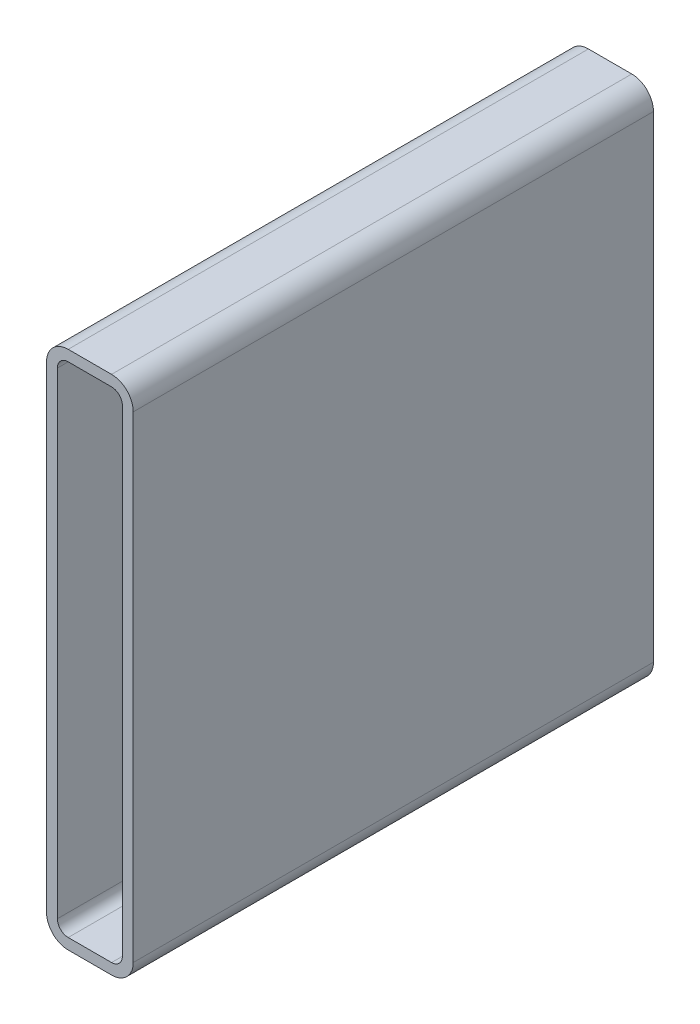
ISO-10303-21;
HEADER;
FILE_DESCRIPTION(('STEP AP214'),'2;1');
FILE_NAME('part.step','',(''),(''),'','','');
FILE_SCHEMA(('AUTOMOTIVE_DESIGN { 1 0 10303 214 1 1 1 1 }'));
ENDSEC;
DATA;
#1=APPLICATION_CONTEXT('core data for automotive mechanical design processes');
#2=APPLICATION_PROTOCOL_DEFINITION('international standard','automotive_design',2000,#1);
#3=PRODUCT_CONTEXT('',#1,'mechanical');
#4=PRODUCT('Part','Part','',(#3));
#5=PRODUCT_RELATED_PRODUCT_CATEGORY('part','',(#4));
#6=PRODUCT_DEFINITION_FORMATION('','',#4);
#7=PRODUCT_DEFINITION_CONTEXT('part definition',#1,'design');
#8=PRODUCT_DEFINITION('design','',#6,#7);
#9=PRODUCT_DEFINITION_SHAPE('','',#8);
#10=(LENGTH_UNIT() NAMED_UNIT(*) SI_UNIT(.MILLI.,.METRE.));
#11=(NAMED_UNIT(*) PLANE_ANGLE_UNIT() SI_UNIT($,.RADIAN.));
#12=(NAMED_UNIT(*) SI_UNIT($,.STERADIAN.) SOLID_ANGLE_UNIT());
#13=UNCERTAINTY_MEASURE_WITH_UNIT(LENGTH_MEASURE(1.E-05),#10,'distance_accuracy_value','');
#14=(GEOMETRIC_REPRESENTATION_CONTEXT(3) GLOBAL_UNCERTAINTY_ASSIGNED_CONTEXT((#13)) GLOBAL_UNIT_ASSIGNED_CONTEXT((#10,
#11,#12)) REPRESENTATION_CONTEXT('',''));
#15=CARTESIAN_POINT('',(0.,0.,0.));
#16=DIRECTION('',(0.,0.,1.));
#17=DIRECTION('',(1.,0.,0.));
#18=AXIS2_PLACEMENT_3D('',#15,#16,#17);
#19=CARTESIAN_POINT('',(12.7,292.1,304.8));
#20=DIRECTION('',(0.,0.,1.));
#21=DIRECTION('',(1.,0.,0.));
#22=AXIS2_PLACEMENT_3D('',#19,#20,#21);
#23=PLANE('',#22);
#24=CARTESIAN_POINT('',(12.7,292.1,304.8));
#25=DIRECTION('',(0.,0.,1.));
#26=DIRECTION('',(1.,0.,0.));
#27=AXIS2_PLACEMENT_3D('',#24,#25,#26);
#28=CIRCLE('',#27,12.7);
#29=CARTESIAN_POINT('',(12.7,304.8,304.8));
#30=VERTEX_POINT('',#29);
#31=CARTESIAN_POINT('',(0.,292.1,304.8));
#32=VERTEX_POINT('',#31);
#33=EDGE_CURVE('E211',#30,#32,#28,.T.);
#34=ORIENTED_EDGE('',*,*,#33,.T.);
#35=DIRECTION('',(0.,-1.,0.));
#36=VECTOR('',#35,1.);
#37=CARTESIAN_POINT('',(0.,12.7,304.8));
#38=LINE('',#37,#36);
#39=CARTESIAN_POINT('',(0.,12.7,304.8));
#40=VERTEX_POINT('',#39);
#41=EDGE_CURVE('E214',#32,#40,#38,.T.);
#42=ORIENTED_EDGE('',*,*,#41,.T.);
#43=CARTESIAN_POINT('',(12.7,12.7,304.8));
#44=DIRECTION('',(0.,0.,1.));
#45=DIRECTION('',(1.,0.,0.));
#46=AXIS2_PLACEMENT_3D('',#43,#44,#45);
#47=CIRCLE('',#46,12.7);
#48=CARTESIAN_POINT('',(12.7,0.,304.8));
#49=VERTEX_POINT('',#48);
#50=EDGE_CURVE('E217',#40,#49,#47,.T.);
#51=ORIENTED_EDGE('',*,*,#50,.T.);
#52=DIRECTION('',(1.,0.,0.));
#53=VECTOR('',#52,1.);
#54=CARTESIAN_POINT('',(38.1,0.,304.8));
#55=LINE('',#54,#53);
#56=CARTESIAN_POINT('',(38.1,0.,304.8));
#57=VERTEX_POINT('',#56);
#58=EDGE_CURVE('E219',#49,#57,#55,.T.);
#59=ORIENTED_EDGE('',*,*,#58,.T.);
#60=CARTESIAN_POINT('',(38.1,12.7,304.8));
#61=DIRECTION('',(0.,0.,1.));
#62=DIRECTION('',(1.,0.,0.));
#63=AXIS2_PLACEMENT_3D('',#60,#61,#62);
#64=CIRCLE('',#63,12.7);
#65=CARTESIAN_POINT('',(50.8,12.7,304.8));
#66=VERTEX_POINT('',#65);
#67=EDGE_CURVE('E221',#57,#66,#64,.T.);
#68=ORIENTED_EDGE('',*,*,#67,.T.);
#69=DIRECTION('',(0.,1.,0.));
#70=VECTOR('',#69,1.);
#71=CARTESIAN_POINT('',(50.8,292.1,304.8));
#72=LINE('',#71,#70);
#73=CARTESIAN_POINT('',(50.8,292.1,304.8));
#74=VERTEX_POINT('',#73);
#75=EDGE_CURVE('E223',#66,#74,#72,.T.);
#76=ORIENTED_EDGE('',*,*,#75,.T.);
#77=CARTESIAN_POINT('',(38.1,292.1,304.8));
#78=DIRECTION('',(0.,0.,1.));
#79=DIRECTION('',(1.,0.,0.));
#80=AXIS2_PLACEMENT_3D('',#77,#78,#79);
#81=CIRCLE('',#80,12.7);
#82=CARTESIAN_POINT('',(38.1,304.8,304.8));
#83=VERTEX_POINT('',#82);
#84=EDGE_CURVE('E225',#74,#83,#81,.T.);
#85=ORIENTED_EDGE('',*,*,#84,.T.);
#86=DIRECTION('',(-1.,0.,0.));
#87=VECTOR('',#86,1.);
#88=CARTESIAN_POINT('',(12.7,304.8,304.8));
#89=LINE('',#88,#87);
#90=EDGE_CURVE('E227',#83,#30,#89,.T.);
#91=ORIENTED_EDGE('',*,*,#90,.T.);
#92=EDGE_LOOP('',(#34,#42,#51,#59,#68,#76,#85,#91));
#93=FACE_BOUND('',#92,.T.);
#94=DIRECTION('',(0.,-1.,0.));
#95=VECTOR('',#94,1.);
#96=CARTESIAN_POINT('',(6.35,12.7,304.8));
#97=LINE('',#96,#95);
#98=CARTESIAN_POINT('',(6.35,292.1,304.8));
#99=VERTEX_POINT('',#98);
#100=CARTESIAN_POINT('',(6.35,12.7,304.8));
#101=VERTEX_POINT('',#100);
#102=EDGE_CURVE('E154',#99,#101,#97,.T.);
#103=ORIENTED_EDGE('',*,*,#102,.F.);
#104=CARTESIAN_POINT('',(12.7,292.1,304.8));
#105=DIRECTION('',(0.,0.,1.));
#106=DIRECTION('',(1.,0.,0.));
#107=AXIS2_PLACEMENT_3D('',#104,#105,#106);
#108=CIRCLE('',#107,6.35000000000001);
#109=CARTESIAN_POINT('',(12.7,298.45,304.8));
#110=VERTEX_POINT('',#109);
#111=EDGE_CURVE('E146',#110,#99,#108,.T.);
#112=ORIENTED_EDGE('',*,*,#111,.F.);
#113=DIRECTION('',(-1.,0.,0.));
#114=VECTOR('',#113,1.);
#115=CARTESIAN_POINT('',(12.7,298.45,304.8));
#116=LINE('',#115,#114);
#117=CARTESIAN_POINT('',(38.1,298.45,304.8));
#118=VERTEX_POINT('',#117);
#119=EDGE_CURVE('E179',#118,#110,#116,.T.);
#120=ORIENTED_EDGE('',*,*,#119,.F.);
#121=CARTESIAN_POINT('',(38.1,292.1,304.8));
#122=DIRECTION('',(0.,0.,1.));
#123=DIRECTION('',(1.,0.,0.));
#124=AXIS2_PLACEMENT_3D('',#121,#122,#123);
#125=CIRCLE('',#124,6.35000000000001);
#126=CARTESIAN_POINT('',(44.45,292.1,304.8));
#127=VERTEX_POINT('',#126);
#128=EDGE_CURVE('E177',#127,#118,#125,.T.);
#129=ORIENTED_EDGE('',*,*,#128,.F.);
#130=DIRECTION('',(0.,1.,0.));
#131=VECTOR('',#130,1.);
#132=CARTESIAN_POINT('',(44.45,292.1,304.8));
#133=LINE('',#132,#131);
#134=CARTESIAN_POINT('',(44.45,12.7,304.8));
#135=VERTEX_POINT('',#134);
#136=EDGE_CURVE('E175',#135,#127,#133,.T.);
#137=ORIENTED_EDGE('',*,*,#136,.F.);
#138=CARTESIAN_POINT('',(38.1,12.7,304.8));
#139=DIRECTION('',(0.,0.,1.));
#140=DIRECTION('',(1.,0.,0.));
#141=AXIS2_PLACEMENT_3D('',#138,#139,#140);
#142=CIRCLE('',#141,6.35);
#143=CARTESIAN_POINT('',(38.1,6.35,304.8));
#144=VERTEX_POINT('',#143);
#145=EDGE_CURVE('E173',#144,#135,#142,.T.);
#146=ORIENTED_EDGE('',*,*,#145,.F.);
#147=DIRECTION('',(1.,0.,0.));
#148=VECTOR('',#147,1.);
#149=CARTESIAN_POINT('',(38.1,6.35,304.8));
#150=LINE('',#149,#148);
#151=CARTESIAN_POINT('',(12.7,6.35,304.8));
#152=VERTEX_POINT('',#151);
#153=EDGE_CURVE('E169',#152,#144,#150,.T.);
#154=ORIENTED_EDGE('',*,*,#153,.F.);
#155=CARTESIAN_POINT('',(12.7,12.7,304.8));
#156=DIRECTION('',(0.,0.,1.));
#157=DIRECTION('',(1.,0.,0.));
#158=AXIS2_PLACEMENT_3D('',#155,#156,#157);
#159=CIRCLE('',#158,6.35);
#160=EDGE_CURVE('E167',#101,#152,#159,.T.);
#161=ORIENTED_EDGE('',*,*,#160,.F.);
#162=EDGE_LOOP('',(#103,#112,#120,#129,#137,#146,#154,#161));
#163=FACE_BOUND('',#162,.T.);
#164=ADVANCED_FACE('F33',(#93,#163),#23,.T.);
#165=CARTESIAN_POINT('',(12.7,292.1,0.));
#166=DIRECTION('',(0.,0.,1.));
#167=DIRECTION('',(1.,0.,0.));
#168=AXIS2_PLACEMENT_3D('',#165,#166,#167);
#169=PLANE('',#168);
#170=CARTESIAN_POINT('',(12.7,292.1,0.));
#171=DIRECTION('',(0.,0.,1.));
#172=DIRECTION('',(1.,0.,0.));
#173=AXIS2_PLACEMENT_3D('',#170,#171,#172);
#174=CIRCLE('',#173,12.7);
#175=CARTESIAN_POINT('',(12.7,304.8,0.));
#176=VERTEX_POINT('',#175);
#177=CARTESIAN_POINT('',(0.,292.1,0.));
#178=VERTEX_POINT('',#177);
#179=EDGE_CURVE('E162',#176,#178,#174,.T.);
#180=ORIENTED_EDGE('',*,*,#179,.F.);
#181=DIRECTION('',(-1.,0.,0.));
#182=VECTOR('',#181,1.);
#183=CARTESIAN_POINT('',(12.7,304.8,0.));
#184=LINE('',#183,#182);
#185=CARTESIAN_POINT('',(38.1,304.8,0.));
#186=VERTEX_POINT('',#185);
#187=EDGE_CURVE('E215',#186,#176,#184,.T.);
#188=ORIENTED_EDGE('',*,*,#187,.F.);
#189=CARTESIAN_POINT('',(38.1,292.1,0.));
#190=DIRECTION('',(0.,0.,1.));
#191=DIRECTION('',(1.,0.,0.));
#192=AXIS2_PLACEMENT_3D('',#189,#190,#191);
#193=CIRCLE('',#192,12.7);
#194=CARTESIAN_POINT('',(50.8,292.1,0.));
#195=VERTEX_POINT('',#194);
#196=EDGE_CURVE('E242',#195,#186,#193,.T.);
#197=ORIENTED_EDGE('',*,*,#196,.F.);
#198=DIRECTION('',(0.,1.,0.));
#199=VECTOR('',#198,1.);
#200=CARTESIAN_POINT('',(50.8,292.1,0.));
#201=LINE('',#200,#199);
#202=CARTESIAN_POINT('',(50.8,12.7,0.));
#203=VERTEX_POINT('',#202);
#204=EDGE_CURVE('E240',#203,#195,#201,.T.);
#205=ORIENTED_EDGE('',*,*,#204,.F.);
#206=CARTESIAN_POINT('',(38.1,12.7,0.));
#207=DIRECTION('',(0.,0.,1.));
#208=DIRECTION('',(1.,0.,0.));
#209=AXIS2_PLACEMENT_3D('',#206,#207,#208);
#210=CIRCLE('',#209,12.7);
#211=CARTESIAN_POINT('',(38.1,0.,0.));
#212=VERTEX_POINT('',#211);
#213=EDGE_CURVE('E238',#212,#203,#210,.T.);
#214=ORIENTED_EDGE('',*,*,#213,.F.);
#215=DIRECTION('',(1.,0.,0.));
#216=VECTOR('',#215,1.);
#217=CARTESIAN_POINT('',(38.1,0.,0.));
#218=LINE('',#217,#216);
#219=CARTESIAN_POINT('',(12.7,0.,0.));
#220=VERTEX_POINT('',#219);
#221=EDGE_CURVE('E236',#220,#212,#218,.T.);
#222=ORIENTED_EDGE('',*,*,#221,.F.);
#223=CARTESIAN_POINT('',(12.7,12.7,0.));
#224=DIRECTION('',(0.,0.,1.));
#225=DIRECTION('',(1.,0.,0.));
#226=AXIS2_PLACEMENT_3D('',#223,#224,#225);
#227=CIRCLE('',#226,12.7);
#228=CARTESIAN_POINT('',(0.,12.7,0.));
#229=VERTEX_POINT('',#228);
#230=EDGE_CURVE('E234',#229,#220,#227,.T.);
#231=ORIENTED_EDGE('',*,*,#230,.F.);
#232=DIRECTION('',(0.,-1.,0.));
#233=VECTOR('',#232,1.);
#234=CARTESIAN_POINT('',(0.,12.7,0.));
#235=LINE('',#234,#233);
#236=EDGE_CURVE('E232',#178,#229,#235,.T.);
#237=ORIENTED_EDGE('',*,*,#236,.F.);
#238=EDGE_LOOP('',(#180,#188,#197,#205,#214,#222,#231,#237));
#239=FACE_BOUND('',#238,.T.);
#240=CARTESIAN_POINT('',(12.7,292.1,0.));
#241=DIRECTION('',(0.,0.,1.));
#242=DIRECTION('',(1.,0.,0.));
#243=AXIS2_PLACEMENT_3D('',#240,#241,#242);
#244=CIRCLE('',#243,6.35000000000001);
#245=CARTESIAN_POINT('',(12.7,298.45,0.));
#246=VERTEX_POINT('',#245);
#247=CARTESIAN_POINT('',(6.35,292.1,0.));
#248=VERTEX_POINT('',#247);
#249=EDGE_CURVE('E56',#246,#248,#244,.T.);
#250=ORIENTED_EDGE('',*,*,#249,.T.);
#251=DIRECTION('',(0.,-1.,0.));
#252=VECTOR('',#251,1.);
#253=CARTESIAN_POINT('',(6.35,12.7,0.));
#254=LINE('',#253,#252);
#255=CARTESIAN_POINT('',(6.35,12.7,0.));
#256=VERTEX_POINT('',#255);
#257=EDGE_CURVE('E161',#248,#256,#254,.T.);
#258=ORIENTED_EDGE('',*,*,#257,.T.);
#259=CARTESIAN_POINT('',(12.7,12.7,0.));
#260=DIRECTION('',(0.,0.,1.));
#261=DIRECTION('',(1.,0.,0.));
#262=AXIS2_PLACEMENT_3D('',#259,#260,#261);
#263=CIRCLE('',#262,6.35);
#264=CARTESIAN_POINT('',(12.7,6.35,0.));
#265=VERTEX_POINT('',#264);
#266=EDGE_CURVE('E183',#256,#265,#263,.T.);
#267=ORIENTED_EDGE('',*,*,#266,.T.);
#268=DIRECTION('',(1.,0.,0.));
#269=VECTOR('',#268,1.);
#270=CARTESIAN_POINT('',(38.1,6.35,0.));
#271=LINE('',#270,#269);
#272=CARTESIAN_POINT('',(38.1,6.35,0.));
#273=VERTEX_POINT('',#272);
#274=EDGE_CURVE('E186',#265,#273,#271,.T.);
#275=ORIENTED_EDGE('',*,*,#274,.T.);
#276=CARTESIAN_POINT('',(38.1,12.7,0.));
#277=DIRECTION('',(0.,0.,1.));
#278=DIRECTION('',(1.,0.,0.));
#279=AXIS2_PLACEMENT_3D('',#276,#277,#278);
#280=CIRCLE('',#279,6.35);
#281=CARTESIAN_POINT('',(44.45,12.7,0.));
#282=VERTEX_POINT('',#281);
#283=EDGE_CURVE('E189',#273,#282,#280,.T.);
#284=ORIENTED_EDGE('',*,*,#283,.T.);
#285=DIRECTION('',(0.,1.,0.));
#286=VECTOR('',#285,1.);
#287=CARTESIAN_POINT('',(44.45,292.1,0.));
#288=LINE('',#287,#286);
#289=CARTESIAN_POINT('',(44.45,292.1,0.));
#290=VERTEX_POINT('',#289);
#291=EDGE_CURVE('E192',#282,#290,#288,.T.);
#292=ORIENTED_EDGE('',*,*,#291,.T.);
#293=CARTESIAN_POINT('',(38.1,292.1,0.));
#294=DIRECTION('',(0.,0.,1.));
#295=DIRECTION('',(1.,0.,0.));
#296=AXIS2_PLACEMENT_3D('',#293,#294,#295);
#297=CIRCLE('',#296,6.35000000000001);
#298=CARTESIAN_POINT('',(38.1,298.45,0.));
#299=VERTEX_POINT('',#298);
#300=EDGE_CURVE('E195',#290,#299,#297,.T.);
#301=ORIENTED_EDGE('',*,*,#300,.T.);
#302=DIRECTION('',(-1.,0.,0.));
#303=VECTOR('',#302,1.);
#304=CARTESIAN_POINT('',(12.7,298.45,0.));
#305=LINE('',#304,#303);
#306=EDGE_CURVE('E155',#299,#246,#305,.T.);
#307=ORIENTED_EDGE('',*,*,#306,.T.);
#308=EDGE_LOOP('',(#250,#258,#267,#275,#284,#292,#301,#307));
#309=FACE_BOUND('',#308,.T.);
#310=ADVANCED_FACE('F272',(#239,#309),#169,.F.);
#311=CARTESIAN_POINT('',(12.7,292.1,304.8));
#312=DIRECTION('',(0.,0.,-1.));
#313=DIRECTION('',(-1.,0.,0.));
#314=AXIS2_PLACEMENT_3D('',#311,#312,#313);
#315=CYLINDRICAL_SURFACE('',#314,12.7);
#316=ORIENTED_EDGE('',*,*,#179,.T.);
#317=DIRECTION('',(0.,0.,-1.));
#318=VECTOR('',#317,1.);
#319=CARTESIAN_POINT('',(0.,292.1,304.8));
#320=LINE('',#319,#318);
#321=EDGE_CURVE('E11',#32,#178,#320,.T.);
#322=ORIENTED_EDGE('',*,*,#321,.F.);
#323=ORIENTED_EDGE('',*,*,#33,.F.);
#324=DIRECTION('',(0.,0.,-1.));
#325=VECTOR('',#324,1.);
#326=CARTESIAN_POINT('',(12.7,304.8,304.8));
#327=LINE('',#326,#325);
#328=EDGE_CURVE('E229',#30,#176,#327,.T.);
#329=ORIENTED_EDGE('',*,*,#328,.T.);
#330=EDGE_LOOP('',(#316,#322,#323,#329));
#331=FACE_BOUND('',#330,.T.);
#332=ADVANCED_FACE('F35',(#331),#315,.T.);
#333=CARTESIAN_POINT('',(0.,12.7,304.8));
#334=DIRECTION('',(1.,0.,0.));
#335=DIRECTION('',(0.,0.,-1.));
#336=AXIS2_PLACEMENT_3D('',#333,#334,#335);
#337=PLANE('',#336);
#338=ORIENTED_EDGE('',*,*,#236,.T.);
#339=DIRECTION('',(0.,0.,-1.));
#340=VECTOR('',#339,1.);
#341=CARTESIAN_POINT('',(0.,12.7,304.8));
#342=LINE('',#341,#340);
#343=EDGE_CURVE('E41',#40,#229,#342,.T.);
#344=ORIENTED_EDGE('',*,*,#343,.F.);
#345=ORIENTED_EDGE('',*,*,#41,.F.);
#346=ORIENTED_EDGE('',*,*,#321,.T.);
#347=EDGE_LOOP('',(#338,#344,#345,#346));
#348=FACE_BOUND('',#347,.T.);
#349=ADVANCED_FACE('F289',(#348),#337,.F.);
#350=CARTESIAN_POINT('',(12.7,12.7,304.8));
#351=DIRECTION('',(0.,0.,-1.));
#352=DIRECTION('',(-1.,0.,0.));
#353=AXIS2_PLACEMENT_3D('',#350,#351,#352);
#354=CYLINDRICAL_SURFACE('',#353,12.7);
#355=ORIENTED_EDGE('',*,*,#230,.T.);
#356=DIRECTION('',(0.,0.,-1.));
#357=VECTOR('',#356,1.);
#358=CARTESIAN_POINT('',(12.7,0.,304.8));
#359=LINE('',#358,#357);
#360=EDGE_CURVE('E259',#49,#220,#359,.T.);
#361=ORIENTED_EDGE('',*,*,#360,.F.);
#362=ORIENTED_EDGE('',*,*,#50,.F.);
#363=ORIENTED_EDGE('',*,*,#343,.T.);
#364=EDGE_LOOP('',(#355,#361,#362,#363));
#365=FACE_BOUND('',#364,.T.);
#366=ADVANCED_FACE('F266',(#365),#354,.T.);
#367=CARTESIAN_POINT('',(38.1,0.,304.8));
#368=DIRECTION('',(0.,1.,0.));
#369=DIRECTION('',(0.,0.,1.));
#370=AXIS2_PLACEMENT_3D('',#367,#368,#369);
#371=PLANE('',#370);
#372=ORIENTED_EDGE('',*,*,#221,.T.);
#373=DIRECTION('',(0.,0.,-1.));
#374=VECTOR('',#373,1.);
#375=CARTESIAN_POINT('',(38.1,0.,304.8));
#376=LINE('',#375,#374);
#377=EDGE_CURVE('E256',#57,#212,#376,.T.);
#378=ORIENTED_EDGE('',*,*,#377,.F.);
#379=ORIENTED_EDGE('',*,*,#58,.F.);
#380=ORIENTED_EDGE('',*,*,#360,.T.);
#381=EDGE_LOOP('',(#372,#378,#379,#380));
#382=FACE_BOUND('',#381,.T.);
#383=ADVANCED_FACE('F278',(#382),#371,.F.);
#384=CARTESIAN_POINT('',(38.1,12.7,304.8));
#385=DIRECTION('',(0.,0.,-1.));
#386=DIRECTION('',(-1.,0.,0.));
#387=AXIS2_PLACEMENT_3D('',#384,#385,#386);
#388=CYLINDRICAL_SURFACE('',#387,12.7);
#389=ORIENTED_EDGE('',*,*,#213,.T.);
#390=DIRECTION('',(0.,0.,-1.));
#391=VECTOR('',#390,1.);
#392=CARTESIAN_POINT('',(50.8,12.7,304.8));
#393=LINE('',#392,#391);
#394=EDGE_CURVE('E253',#66,#203,#393,.T.);
#395=ORIENTED_EDGE('',*,*,#394,.F.);
#396=ORIENTED_EDGE('',*,*,#67,.F.);
#397=ORIENTED_EDGE('',*,*,#377,.T.);
#398=EDGE_LOOP('',(#389,#395,#396,#397));
#399=FACE_BOUND('',#398,.T.);
#400=ADVANCED_FACE('F282',(#399),#388,.T.);
#401=CARTESIAN_POINT('',(50.8,292.1,304.8));
#402=DIRECTION('',(-1.,0.,0.));
#403=DIRECTION('',(0.,0.,1.));
#404=AXIS2_PLACEMENT_3D('',#401,#402,#403);
#405=PLANE('',#404);
#406=ORIENTED_EDGE('',*,*,#204,.T.);
#407=DIRECTION('',(0.,0.,-1.));
#408=VECTOR('',#407,1.);
#409=CARTESIAN_POINT('',(50.8,292.1,304.8));
#410=LINE('',#409,#408);
#411=EDGE_CURVE('E250',#74,#195,#410,.T.);
#412=ORIENTED_EDGE('',*,*,#411,.F.);
#413=ORIENTED_EDGE('',*,*,#75,.F.);
#414=ORIENTED_EDGE('',*,*,#394,.T.);
#415=EDGE_LOOP('',(#406,#412,#413,#414));
#416=FACE_BOUND('',#415,.T.);
#417=ADVANCED_FACE('F302',(#416),#405,.F.);
#418=CARTESIAN_POINT('',(38.1,292.1,304.8));
#419=DIRECTION('',(0.,0.,-1.));
#420=DIRECTION('',(-1.,0.,0.));
#421=AXIS2_PLACEMENT_3D('',#418,#419,#420);
#422=CYLINDRICAL_SURFACE('',#421,12.7);
#423=ORIENTED_EDGE('',*,*,#196,.T.);
#424=DIRECTION('',(0.,0.,-1.));
#425=VECTOR('',#424,1.);
#426=CARTESIAN_POINT('',(38.1,304.8,304.8));
#427=LINE('',#426,#425);
#428=EDGE_CURVE('E247',#83,#186,#427,.T.);
#429=ORIENTED_EDGE('',*,*,#428,.F.);
#430=ORIENTED_EDGE('',*,*,#84,.F.);
#431=ORIENTED_EDGE('',*,*,#411,.T.);
#432=EDGE_LOOP('',(#423,#429,#430,#431));
#433=FACE_BOUND('',#432,.T.);
#434=ADVANCED_FACE('F300',(#433),#422,.T.);
#435=CARTESIAN_POINT('',(12.7,304.8,304.8));
#436=DIRECTION('',(0.,-1.,0.));
#437=DIRECTION('',(0.,0.,-1.));
#438=AXIS2_PLACEMENT_3D('',#435,#436,#437);
#439=PLANE('',#438);
#440=ORIENTED_EDGE('',*,*,#187,.T.);
#441=ORIENTED_EDGE('',*,*,#328,.F.);
#442=ORIENTED_EDGE('',*,*,#90,.F.);
#443=ORIENTED_EDGE('',*,*,#428,.T.);
#444=EDGE_LOOP('',(#440,#441,#442,#443));
#445=FACE_BOUND('',#444,.T.);
#446=ADVANCED_FACE('F295',(#445),#439,.F.);
#447=CARTESIAN_POINT('',(12.7,292.1,304.8));
#448=DIRECTION('',(0.,0.,-1.));
#449=DIRECTION('',(-1.,0.,0.));
#450=AXIS2_PLACEMENT_3D('',#447,#448,#449);
#451=CYLINDRICAL_SURFACE('',#450,6.35000000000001);
#452=ORIENTED_EDGE('',*,*,#249,.F.);
#453=DIRECTION('',(0.,0.,-1.));
#454=VECTOR('',#453,1.);
#455=CARTESIAN_POINT('',(12.7,298.45,304.8));
#456=LINE('',#455,#454);
#457=EDGE_CURVE('E150',#110,#246,#456,.T.);
#458=ORIENTED_EDGE('',*,*,#457,.F.);
#459=ORIENTED_EDGE('',*,*,#111,.T.);
#460=DIRECTION('',(0.,0.,-1.));
#461=VECTOR('',#460,1.);
#462=CARTESIAN_POINT('',(6.35,292.1,304.8));
#463=LINE('',#462,#461);
#464=EDGE_CURVE('E149',#99,#248,#463,.T.);
#465=ORIENTED_EDGE('',*,*,#464,.T.);
#466=EDGE_LOOP('',(#452,#458,#459,#465));
#467=FACE_BOUND('',#466,.T.);
#468=ADVANCED_FACE('F148',(#467),#451,.F.);
#469=CARTESIAN_POINT('',(6.35,12.7,304.8));
#470=DIRECTION('',(1.,0.,0.));
#471=DIRECTION('',(0.,0.,-1.));
#472=AXIS2_PLACEMENT_3D('',#469,#470,#471);
#473=PLANE('',#472);
#474=ORIENTED_EDGE('',*,*,#257,.F.);
#475=ORIENTED_EDGE('',*,*,#464,.F.);
#476=ORIENTED_EDGE('',*,*,#102,.T.);
#477=DIRECTION('',(0.,0.,-1.));
#478=VECTOR('',#477,1.);
#479=CARTESIAN_POINT('',(6.35,12.7,304.8));
#480=LINE('',#479,#478);
#481=EDGE_CURVE('E163',#101,#256,#480,.T.);
#482=ORIENTED_EDGE('',*,*,#481,.T.);
#483=EDGE_LOOP('',(#474,#475,#476,#482));
#484=FACE_BOUND('',#483,.T.);
#485=ADVANCED_FACE('F158',(#484),#473,.T.);
#486=CARTESIAN_POINT('',(12.7,12.7,304.8));
#487=DIRECTION('',(0.,0.,-1.));
#488=DIRECTION('',(-1.,0.,0.));
#489=AXIS2_PLACEMENT_3D('',#486,#487,#488);
#490=CYLINDRICAL_SURFACE('',#489,6.35);
#491=ORIENTED_EDGE('',*,*,#266,.F.);
#492=ORIENTED_EDGE('',*,*,#481,.F.);
#493=ORIENTED_EDGE('',*,*,#160,.T.);
#494=DIRECTION('',(0.,0.,-1.));
#495=VECTOR('',#494,1.);
#496=CARTESIAN_POINT('',(12.7,6.35,304.8));
#497=LINE('',#496,#495);
#498=EDGE_CURVE('E208',#152,#265,#497,.T.);
#499=ORIENTED_EDGE('',*,*,#498,.T.);
#500=EDGE_LOOP('',(#491,#492,#493,#499));
#501=FACE_BOUND('',#500,.T.);
#502=ADVANCED_FACE('F327',(#501),#490,.F.);
#503=CARTESIAN_POINT('',(38.1,6.35,304.8));
#504=DIRECTION('',(0.,1.,0.));
#505=DIRECTION('',(0.,0.,1.));
#506=AXIS2_PLACEMENT_3D('',#503,#504,#505);
#507=PLANE('',#506);
#508=ORIENTED_EDGE('',*,*,#274,.F.);
#509=ORIENTED_EDGE('',*,*,#498,.F.);
#510=ORIENTED_EDGE('',*,*,#153,.T.);
#511=DIRECTION('',(0.,0.,-1.));
#512=VECTOR('',#511,1.);
#513=CARTESIAN_POINT('',(38.1,6.35,304.8));
#514=LINE('',#513,#512);
#515=EDGE_CURVE('E206',#144,#273,#514,.T.);
#516=ORIENTED_EDGE('',*,*,#515,.T.);
#517=EDGE_LOOP('',(#508,#509,#510,#516));
#518=FACE_BOUND('',#517,.T.);
#519=ADVANCED_FACE('F331',(#518),#507,.T.);
#520=CARTESIAN_POINT('',(38.1,12.7,304.8));
#521=DIRECTION('',(0.,0.,-1.));
#522=DIRECTION('',(-1.,0.,0.));
#523=AXIS2_PLACEMENT_3D('',#520,#521,#522);
#524=CYLINDRICAL_SURFACE('',#523,6.35);
#525=ORIENTED_EDGE('',*,*,#283,.F.);
#526=ORIENTED_EDGE('',*,*,#515,.F.);
#527=ORIENTED_EDGE('',*,*,#145,.T.);
#528=DIRECTION('',(0.,0.,-1.));
#529=VECTOR('',#528,1.);
#530=CARTESIAN_POINT('',(44.45,12.7,304.8));
#531=LINE('',#530,#529);
#532=EDGE_CURVE('E204',#135,#282,#531,.T.);
#533=ORIENTED_EDGE('',*,*,#532,.T.);
#534=EDGE_LOOP('',(#525,#526,#527,#533));
#535=FACE_BOUND('',#534,.T.);
#536=ADVANCED_FACE('F337',(#535),#524,.F.);
#537=CARTESIAN_POINT('',(44.45,292.1,304.8));
#538=DIRECTION('',(-1.,0.,0.));
#539=DIRECTION('',(0.,0.,1.));
#540=AXIS2_PLACEMENT_3D('',#537,#538,#539);
#541=PLANE('',#540);
#542=ORIENTED_EDGE('',*,*,#291,.F.);
#543=ORIENTED_EDGE('',*,*,#532,.F.);
#544=ORIENTED_EDGE('',*,*,#136,.T.);
#545=DIRECTION('',(0.,0.,-1.));
#546=VECTOR('',#545,1.);
#547=CARTESIAN_POINT('',(44.45,292.1,304.8));
#548=LINE('',#547,#546);
#549=EDGE_CURVE('E202',#127,#290,#548,.T.);
#550=ORIENTED_EDGE('',*,*,#549,.T.);
#551=EDGE_LOOP('',(#542,#543,#544,#550));
#552=FACE_BOUND('',#551,.T.);
#553=ADVANCED_FACE('F341',(#552),#541,.T.);
#554=CARTESIAN_POINT('',(38.1,292.1,304.8));
#555=DIRECTION('',(0.,0.,-1.));
#556=DIRECTION('',(-1.,0.,0.));
#557=AXIS2_PLACEMENT_3D('',#554,#555,#556);
#558=CYLINDRICAL_SURFACE('',#557,6.35000000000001);
#559=ORIENTED_EDGE('',*,*,#300,.F.);
#560=ORIENTED_EDGE('',*,*,#549,.F.);
#561=ORIENTED_EDGE('',*,*,#128,.T.);
#562=DIRECTION('',(0.,0.,-1.));
#563=VECTOR('',#562,1.);
#564=CARTESIAN_POINT('',(38.1,298.45,304.8));
#565=LINE('',#564,#563);
#566=EDGE_CURVE('E48',#118,#299,#565,.T.);
#567=ORIENTED_EDGE('',*,*,#566,.T.);
#568=EDGE_LOOP('',(#559,#560,#561,#567));
#569=FACE_BOUND('',#568,.T.);
#570=ADVANCED_FACE('F345',(#569),#558,.F.);
#571=CARTESIAN_POINT('',(12.7,298.45,304.8));
#572=DIRECTION('',(0.,-1.,0.));
#573=DIRECTION('',(0.,0.,-1.));
#574=AXIS2_PLACEMENT_3D('',#571,#572,#573);
#575=PLANE('',#574);
#576=ORIENTED_EDGE('',*,*,#306,.F.);
#577=ORIENTED_EDGE('',*,*,#566,.F.);
#578=ORIENTED_EDGE('',*,*,#119,.T.);
#579=ORIENTED_EDGE('',*,*,#457,.T.);
#580=EDGE_LOOP('',(#576,#577,#578,#579));
#581=FACE_BOUND('',#580,.T.);
#582=ADVANCED_FACE('F349',(#581),#575,.T.);
#583=CLOSED_SHELL('',(#164,#310,#332,#349,#366,#383,#400,#417,#434,#446,#468,#485,#502,#519,
#536,#553,#570,#582));
#584=MANIFOLD_SOLID_BREP('B2',#583);
#585=ADVANCED_BREP_SHAPE_REPRESENTATION('',(#18,#584),#14);
#586=SHAPE_DEFINITION_REPRESENTATION(#9,#585);
ENDSEC;
END-ISO-10303-21;
